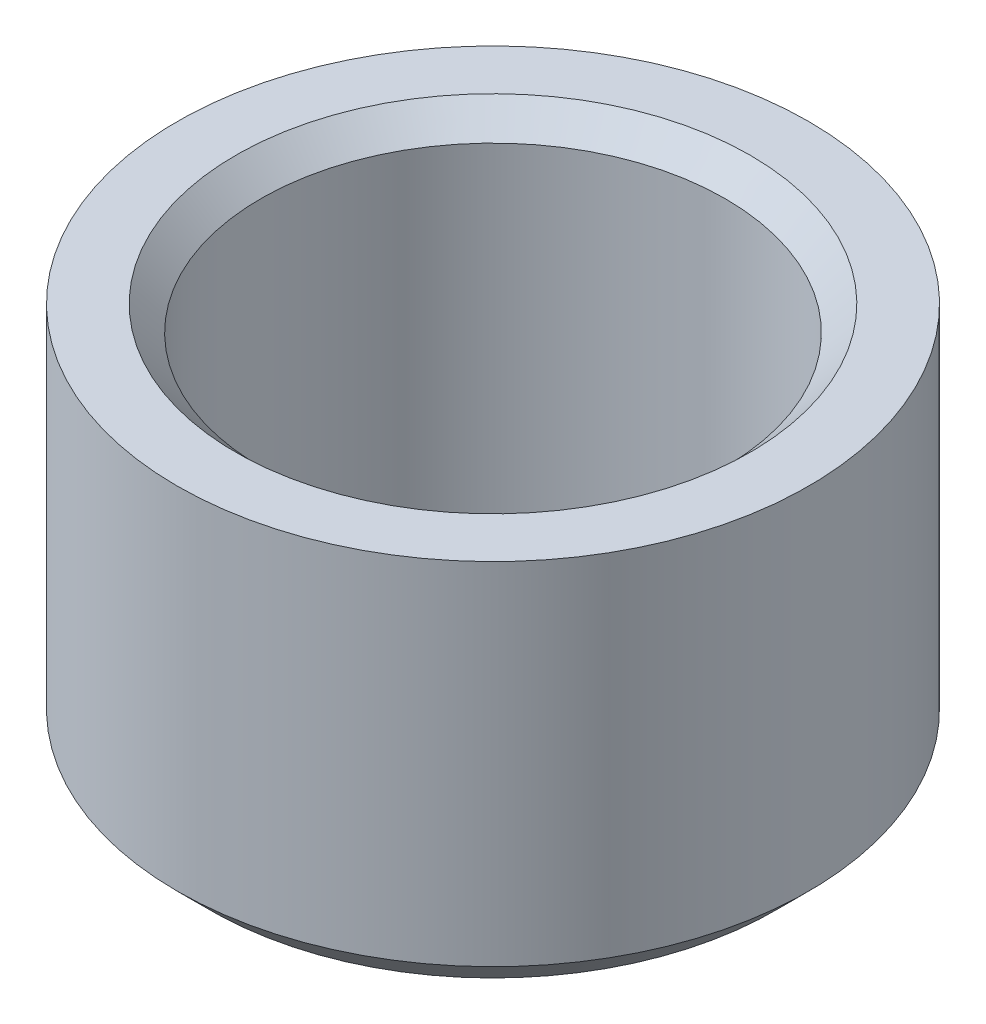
from build123d import *


with BuildPart() as part:
    # Sketch1 → Revolve1 (revolve)
    with BuildSketch(Plane.XY, mode=Mode.PRIVATE) as revolve1_sk:
        Polygon((13.9, 0), (16.9, 0), (18.9, 2), (18.9, 23), (15.4, 23), (13.9, 21.5), align=None)
    revolve(revolve1_sk.sketch.rotate(Axis((0, 0, 0), (0, 1, 0)), 90), axis=Axis((0, 0, 0), (0, 1, 0)))


solid = part.part
